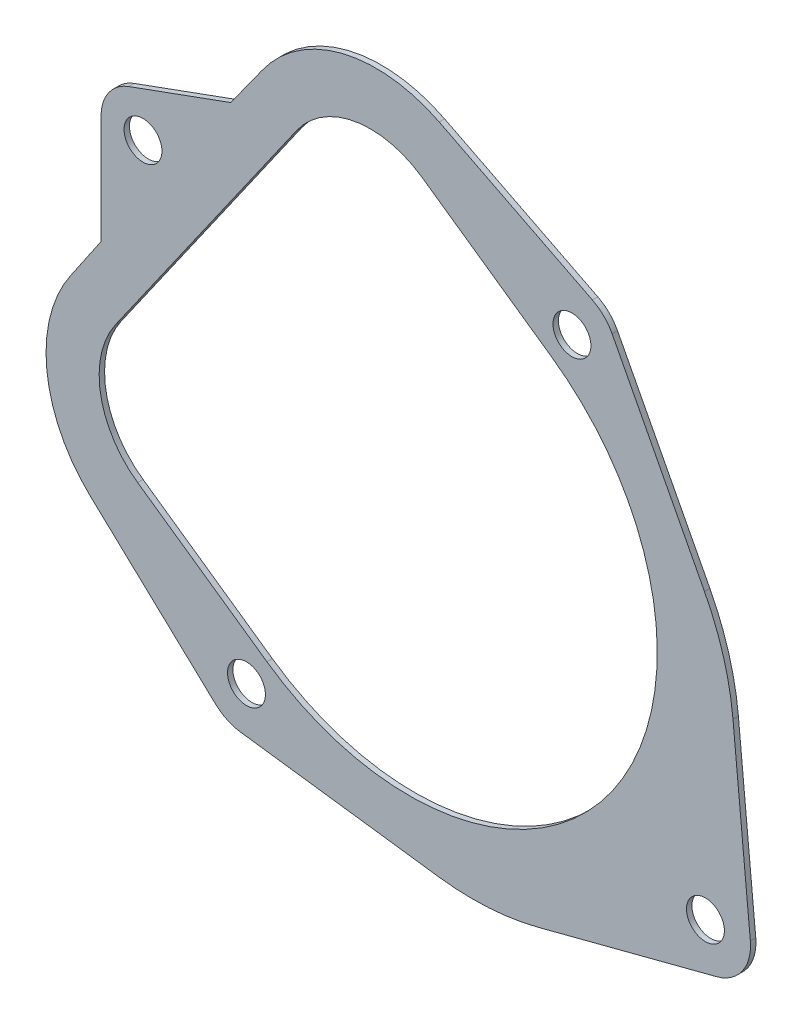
from build123d import *

# Parameters (mm, degrees)
ESQUISSE1_R          = 2.1
BASE_EXTRUSION_DEPTH = 0.3


with BuildPart() as part:
    # Esquisse1 → Base-Extrusion (new, symmetric)
    with BuildSketch(Plane.XY):
        with BuildLine():
            Line((35.615327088, -25.672223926), (33.690495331, -5.355736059))
            ThreePointArc((33.690495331, -5.355736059), (32.627582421, 0.138570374), (30.529161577, 5.326423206))
            Line((30.529161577, 5.326423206), (20.291189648, 24.943575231))
            ThreePointArc((20.291189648, 24.943575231), (19.367522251, 26.19363098), (18.105897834, 27.101433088))
            Line((18.105897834, 27.101433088), (1.120998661, 35.694422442))
            ThreePointArc((1.120998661, 35.694422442), (-9.646140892, 36.898255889), (-18.57139047, 30.756559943))
            Line((-18.57139047, 30.756559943), (-21.986449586, 26.007166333))
            Line((-21.986449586, 26.007166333), (-33.307069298, 21.886797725))
            ThreePointArc((-33.307069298, 21.886797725), (-35.52580407, 20.184302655), (-36.366774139, 17.517086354))
            Line((-36.366774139, 17.517086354), (-36.366774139, 5.469934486))
            Line((-36.366774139, 5.469934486), (-39.661725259, 0.636440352))
            ThreePointArc((-39.661725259, 0.636440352), (-42.380416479, -9.851134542), (-37.566604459, -19.557200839))
            Line((-37.566604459, -19.557200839), (-23.682658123, -32.578809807))
            ThreePointArc((-23.682658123, -32.578809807), (-22.398102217, -33.453862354), (-20.907521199, -33.894281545))
            Line((-20.907521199, -33.894281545), (1.028164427, -36.805367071))
            ThreePointArc((1.028164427, -36.805367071), (6.620853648, -37.002887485), (12.147350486, -36.122535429))
            Line((12.147350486, -36.122535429), (31.896935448, -30.982637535))
            ThreePointArc((31.896935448, -30.982637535), (34.733377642, -29.011706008), (35.615327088, -25.672223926))
        make_face()
        with Locations((15.838548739, 22.619791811)):
            Circle(ESQUISSE1_R, mode=Mode.SUBTRACT)
        with Locations((-31.716624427, 17.517086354)):
            Circle(ESQUISSE1_R, mode=Mode.SUBTRACT)
        with Locations((-20.246771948, -28.915387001)):
            Circle(ESQUISSE1_R, mode=Mode.SUBTRACT)
        with Locations((30.63761742, -26.143823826)):
            Circle(ESQUISSE1_R, mode=Mode.SUBTRACT)
        with BuildLine():
            Line((-34.768380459, -1.709606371), (-14.693205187, 26.96071518))
            ThreePointArc((-14.693205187, 26.96071518), (-8.23816652, 31.073028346), (-0.76592038, 29.416471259))
            Line((-0.76592038, 29.416471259), (13.569240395, 19.378883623))
            ThreePointArc((13.569240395, 19.378883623), (20.322569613, -18.921149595), (-17.977463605, -25.674478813))
            Line((-17.977463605, -25.674478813), (-32.31262438, -15.636891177))
            ThreePointArc((-32.31262438, -15.636891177), (-36.424937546, -9.181852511), (-34.768380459, -1.709606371))
        make_face(mode=Mode.SUBTRACT)
    extrude(amount=BASE_EXTRUSION_DEPTH, both=True)


solid = part.part
